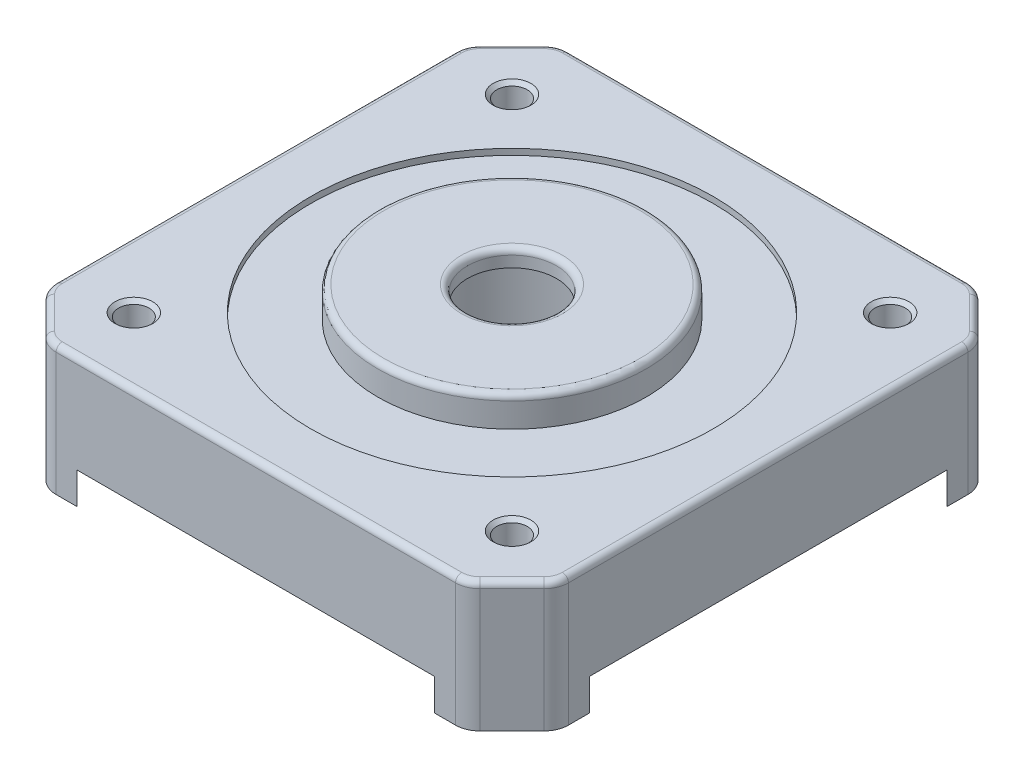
from build123d import *

# Parameters (mm, degrees)
SKETCH_1_R          = 2.65
SKETCH_1_R_2        = 16.5
SKETCH_1_R_3        = 1.25
EXTRUDE_1_DEPTH     = 8
SKETCH_1_3_R        = 16.5
SKETCH_1_3_R_2      = 11
EXTRUDE_2_DEPTH     = 7.5
SKETCH_1_4_R        = 11
SKETCH_1_4_R_2      = 3.65
EXTRUDE_3_DEPTH     = 10
EXTRUDE_4_DEPTH     = 2.6
SKETCH_2_R          = 8
CUT_EXTRUDE_1_DEPTH = 8.6
FILLET_1_R          = 2
FILLET_2_R          = 0.5
CHAMFER_1_SIZE      = 0.3


with BuildPart() as part:
    # Sketch 1 → Extrude 1 (new body)
    # profile 1 of 9: a face of its own
    with BuildSketch(Plane(origin=(0, 0, 0), x_dir=(1, 0, 0), z_dir=(0, 1, 0))):
        with BuildLine():
            ThreePointArc((-14.641038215, 21), (-18.101933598, 18.101933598), (-21, 14.641038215))
            Line((-21, 14.641038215), (-21, -14.641038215))
            ThreePointArc((-21, -14.641038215), (-18.101933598, -18.101933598), (-14.641038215, -21))
            Line((-14.641038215, -21), (14.641038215, -21))
            ThreePointArc((14.641038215, -21), (18.101933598, -18.101933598), (21, -14.641038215))
            Line((21, -14.641038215), (21, 14.641038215))
            ThreePointArc((21, 14.641038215), (18.101933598, 18.101933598), (14.641038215, 21))
            Line((14.641038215, 21), (-14.641038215, 21))
        make_face()
        with Locations((-15.5, -15.5)):
            Circle(SKETCH_1_R, mode=Mode.SUBTRACT)
        with Locations((15.5, -15.5)):
            Circle(SKETCH_1_R, mode=Mode.SUBTRACT)
        with Locations(Location((0, 0, 0), (0, 0, 270))):
            Circle(SKETCH_1_R_2, mode=Mode.SUBTRACT)
        with Locations((-15.5, 15.5)):
            Circle(SKETCH_1_R, mode=Mode.SUBTRACT)
        with Locations((15.5, 15.5)):
            Circle(SKETCH_1_R, mode=Mode.SUBTRACT)
    # profile 2 of 9: a face of its own
    with BuildSketch(Plane(origin=(0, 0, 0), x_dir=(1, 0, 0), z_dir=(0, 1, 0))):
        with Locations((15.5, -15.5)):
            Circle(SKETCH_1_R)
        with Locations(Location((15.5, -15.5, 0), (0, 0, 270))):
            Circle(SKETCH_1_R_3, mode=Mode.SUBTRACT)
    # profile 3 of 9: a face of its own
    with BuildSketch(Plane(origin=(0, 0, 0), x_dir=(1, 0, 0), z_dir=(0, 1, 0))):
        with Locations((-15.5, -15.5)):
            Circle(SKETCH_1_R)
        with Locations(Location((-15.5, -15.5, 0), (0, 0, 270))):
            Circle(SKETCH_1_R_3, mode=Mode.SUBTRACT)
    # profile 4 of 9: a face of its own
    with BuildSketch(Plane(origin=(0, 0, 0), x_dir=(1, 0, 0), z_dir=(0, 1, 0))):
        with Locations((-15.5, 15.5)):
            Circle(SKETCH_1_R)
        with Locations(Location((-15.5, 15.5, 0), (0, 0, 270))):
            Circle(SKETCH_1_R_3, mode=Mode.SUBTRACT)
    # profile 5 of 9: a face of its own
    with BuildSketch(Plane(origin=(0, 0, 0), x_dir=(1, 0, 0), z_dir=(0, 1, 0))):
        with Locations((15.5, 15.5)):
            Circle(SKETCH_1_R)
        with Locations(Location((15.5, 15.5, 0), (0, 0, 270))):
            Circle(SKETCH_1_R_3, mode=Mode.SUBTRACT)
    # profile 6 of 9: a face of its own
    with BuildSketch(Plane(origin=(0, 0, 0), x_dir=(1, 0, 0), z_dir=(0, 1, 0))):
        with BuildLine():
            ThreePointArc((-14.641038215, -21), (-18.101933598, -18.101933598), (-21, -14.641038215))
            Line((-21, -14.641038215), (-21, -17.2))
            Line((-21, -17.2), (-17.2, -21))
            Line((-17.2, -21), (-14.641038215, -21))
        make_face()
    # profile 7 of 9: a face of its own
    with BuildSketch(Plane(origin=(0, 0, 0), x_dir=(1, 0, 0), z_dir=(0, 1, 0))):
        with BuildLine():
            Line((-17.2, 21), (-21, 17.2))
            Line((-21, 17.2), (-21, 14.641038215))
            ThreePointArc((-21, 14.641038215), (-18.101933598, 18.101933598), (-14.641038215, 21))
            Line((-14.641038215, 21), (-17.2, 21))
        make_face()
    # profile 8 of 9: a face of its own
    with BuildSketch(Plane(origin=(0, 0, 0), x_dir=(1, 0, 0), z_dir=(0, 1, 0))):
        with BuildLine():
            Line((17.2, 21), (14.641038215, 21))
            ThreePointArc((14.641038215, 21), (18.101933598, 18.101933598), (21, 14.641038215))
            Line((21, 14.641038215), (21, 17.2))
            Line((21, 17.2), (17.2, 21))
        make_face()
    # profile 9 of 9: a face of its own
    with BuildSketch(Plane(origin=(0, 0, 0), x_dir=(1, 0, 0), z_dir=(0, 1, 0))):
        with BuildLine():
            ThreePointArc((21, -14.641038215), (18.101933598, -18.101933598), (14.641038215, -21))
            Line((14.641038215, -21), (17.2, -21))
            Line((17.2, -21), (21, -17.2))
            Line((21, -17.2), (21, -14.641038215))
        make_face()
    extrude(amount=EXTRUDE_1_DEPTH)

    # Sketch 1_3 → Extrude 2 (add)
    with BuildSketch(Plane(origin=(0, 0, 0), x_dir=(1, 0, 0), z_dir=(0, 1, 0))):
        with Locations(Location((0, 0, 0), (0, 0, 270))):
            Circle(SKETCH_1_3_R)
        with Locations(Location((0, 0, 0), (0, 0, 270))):
            Circle(SKETCH_1_3_R_2, mode=Mode.SUBTRACT)
    extrude(amount=EXTRUDE_2_DEPTH)

    # Sketch 1_4 → Extrude 3 (add)
    with BuildSketch(Plane(origin=(0, 0, 0), x_dir=(1, 0, 0), z_dir=(0, 1, 0))):
        with Locations(Location((0, 0, 0), (0, 0, 270))):
            Circle(SKETCH_1_4_R)
        with Locations(Location((0, 0, 0), (0, 0, 270))):
            Circle(SKETCH_1_4_R_2, mode=Mode.SUBTRACT)
    extrude(amount=EXTRUDE_3_DEPTH)

    # Sketch 1_5 → Extrude 4 (add)
    with BuildSketch(Plane(origin=(0, 0, 0), x_dir=(1, 0, 0), z_dir=(0, 1, 0))):
        with BuildLine():
            ThreePointArc((-14.641038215, -21), (-18.101933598, -18.101933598), (-21, -14.641038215))
            Line((-21, -14.641038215), (-21, -17.2))
            Line((-21, -17.2), (-17.2, -21))
            Line((-17.2, -21), (-14.641038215, -21))
        make_face()
        with BuildLine():
            ThreePointArc((21, -14.641038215), (18.101933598, -18.101933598), (14.641038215, -21))
            Line((14.641038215, -21), (17.2, -21))
            Line((17.2, -21), (21, -17.2))
            Line((21, -17.2), (21, -14.641038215))
        make_face()
        with BuildLine():
            Line((-17.2, 21), (-21, 17.2))
            Line((-21, 17.2), (-21, 14.641038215))
            ThreePointArc((-21, 14.641038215), (-18.101933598, 18.101933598), (-14.641038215, 21))
            Line((-14.641038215, 21), (-17.2, 21))
        make_face()
        with BuildLine():
            Line((17.2, 21), (14.641038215, 21))
            ThreePointArc((14.641038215, 21), (18.101933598, 18.101933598), (21, 14.641038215))
            Line((21, 14.641038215), (21, 17.2))
            Line((21, 17.2), (17.2, 21))
        make_face()
    extrude(amount=-EXTRUDE_4_DEPTH)

    # Sketch 2 → Cut-Extrude 1 (cut)
    with BuildSketch(Plane.XZ):
        with Locations(Location((0, 0, 0), (0, 0, 270))):
            Circle(SKETCH_2_R)
    extrude(amount=-CUT_EXTRUDE_1_DEPTH, mode=Mode.SUBTRACT)

    # Fillet 1
    fillet_1_edges = [part.edges().sort_by_distance(p)[0] for p in [
        (-17.2, 2.7, 21),
        (-21, 2.7, 17.2),
        (-21, 2.7, -17.2),
        (-17.2, 2.7, -21),
        (17.2, 2.7, -21),
        (21, 2.7, -17.2),
        (21, 2.7, 17.2),
        (17.2, 2.7, 21),
    ]]
    fillet(fillet_1_edges, radius=FILLET_1_R)

    # Fillet 2
    fillet_2_edges = [part.edges().sort_by_distance(p)[0] for p in [
        (21, 8, 0),
        (19.1, 8, 19.1),
        (0, 8, 21),
        (19.1, 8, -19.1),
        (0, 8, -21),
        (-19.1, 8, -19.1),
        (-21, 8, 0),
        (-19.1, 8, 19.1),
        (20.847759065, 8, -17.13693974),
        (17.13693974, 8, -20.847759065),
        (-17.13693974, 8, -20.847759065),
        (-20.847759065, 8, -17.13693974),
        (-20.847759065, 8, 17.13693974),
        (-17.13693974, 8, 20.847759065),
        (17.13693974, 8, 20.847759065),
        (20.847759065, 8, 17.13693974),
        (0, 10, -3.65),
        (0, 10, -11),
    ]]
    fillet(fillet_2_edges, radius=FILLET_2_R)

    # Chamfer 1
    chamfer_1_edges = [part.edges().sort_by_distance(p)[0] for p in [
        (-15.5, 8, -16.75),
        (15.5, 8, -16.75),
        (15.5, 8, 14.25),
        (-15.5, 8, 14.25),
    ]]
    chamfer(chamfer_1_edges, length=CHAMFER_1_SIZE)


solid = part.part
